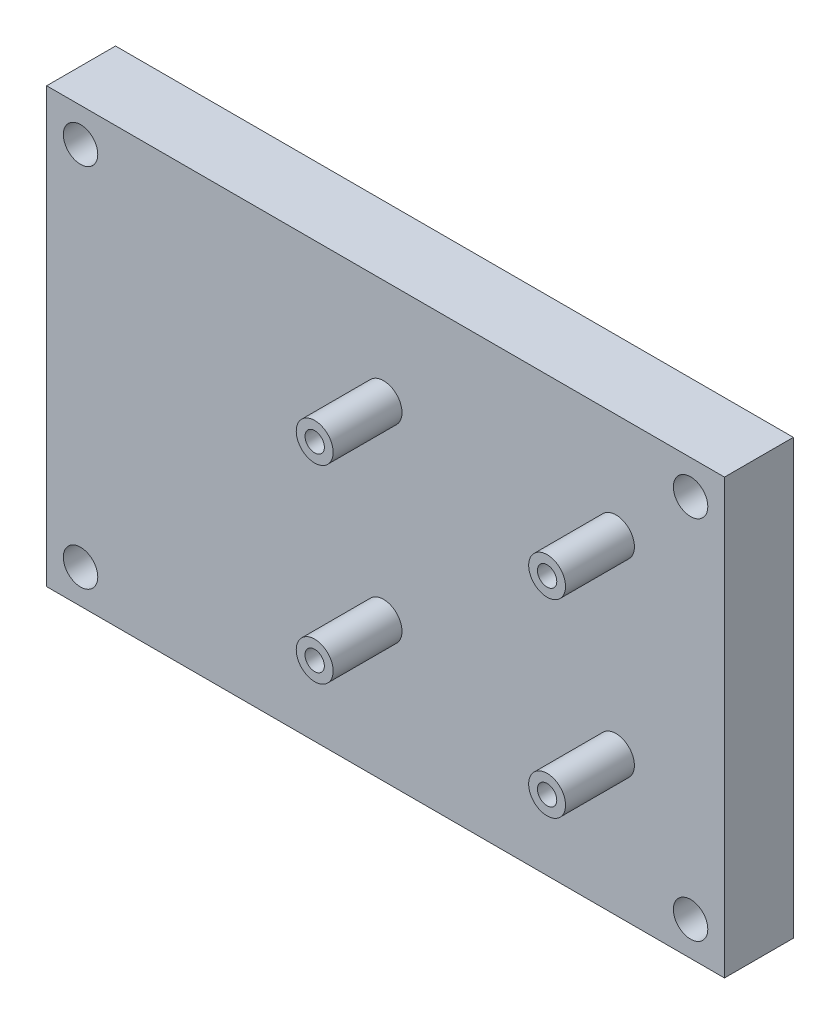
ISO-10303-21;
HEADER;
FILE_DESCRIPTION(('STEP AP214'),'2;1');
FILE_NAME('part.step','',(''),(''),'','','');
FILE_SCHEMA(('AUTOMOTIVE_DESIGN { 1 0 10303 214 1 1 1 1 }'));
ENDSEC;
DATA;
#1=APPLICATION_CONTEXT('core data for automotive mechanical design processes');
#2=APPLICATION_PROTOCOL_DEFINITION('international standard','automotive_design',2000,#1);
#3=PRODUCT_CONTEXT('',#1,'mechanical');
#4=PRODUCT('Part','Part','',(#3));
#5=PRODUCT_RELATED_PRODUCT_CATEGORY('part','',(#4));
#6=PRODUCT_DEFINITION_FORMATION('','',#4);
#7=PRODUCT_DEFINITION_CONTEXT('part definition',#1,'design');
#8=PRODUCT_DEFINITION('design','',#6,#7);
#9=PRODUCT_DEFINITION_SHAPE('','',#8);
#10=(LENGTH_UNIT() NAMED_UNIT(*) SI_UNIT(.MILLI.,.METRE.));
#11=(NAMED_UNIT(*) PLANE_ANGLE_UNIT() SI_UNIT($,.RADIAN.));
#12=(NAMED_UNIT(*) SI_UNIT($,.STERADIAN.) SOLID_ANGLE_UNIT());
#13=UNCERTAINTY_MEASURE_WITH_UNIT(LENGTH_MEASURE(1.E-05),#10,'distance_accuracy_value','');
#14=(GEOMETRIC_REPRESENTATION_CONTEXT(3) GLOBAL_UNCERTAINTY_ASSIGNED_CONTEXT((#13)) GLOBAL_UNIT_ASSIGNED_CONTEXT((#10,
#11,#12)) REPRESENTATION_CONTEXT('',''));
#15=CARTESIAN_POINT('',(0.,0.,0.));
#16=DIRECTION('',(0.,0.,1.));
#17=DIRECTION('',(1.,0.,0.));
#18=AXIS2_PLACEMENT_3D('',#15,#16,#17);
#19=CARTESIAN_POINT('',(0.,0.,0.));
#20=DIRECTION('',(0.,0.,-1.));
#21=DIRECTION('',(-1.,0.,0.));
#22=AXIS2_PLACEMENT_3D('',#19,#20,#21);
#23=PLANE('',#22);
#24=CARTESIAN_POINT('',(62.1283709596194,60.5614108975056,0.));
#25=DIRECTION('',(0.,0.,1.));
#26=DIRECTION('',(1.,0.,0.));
#27=AXIS2_PLACEMENT_3D('',#24,#25,#26);
#28=CIRCLE('',#27,1.78434999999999);
#29=CARTESIAN_POINT('',(63.9127209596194,60.5614108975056,0.));
#30=VERTEX_POINT('',#29);
#31=EDGE_CURVE('E233',#30,#30,#28,.T.);
#32=ORIENTED_EDGE('',*,*,#31,.T.);
#33=EDGE_LOOP('',(#32));
#34=FACE_BOUND('',#33,.T.);
#35=CARTESIAN_POINT('',(104.990870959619,60.5614108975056,0.));
#36=DIRECTION('',(0.,0.,1.));
#37=DIRECTION('',(1.,0.,0.));
#38=AXIS2_PLACEMENT_3D('',#35,#36,#37);
#39=CIRCLE('',#38,1.78434999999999);
#40=CARTESIAN_POINT('',(106.775220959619,60.5614108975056,0.));
#41=VERTEX_POINT('',#40);
#42=EDGE_CURVE('E225',#41,#41,#39,.T.);
#43=ORIENTED_EDGE('',*,*,#42,.T.);
#44=EDGE_LOOP('',(#43));
#45=FACE_BOUND('',#44,.T.);
#46=CARTESIAN_POINT('',(104.988370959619,25.6364108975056,0.));
#47=DIRECTION('',(0.,0.,1.));
#48=DIRECTION('',(1.,0.,0.));
#49=AXIS2_PLACEMENT_3D('',#46,#47,#48);
#50=CIRCLE('',#49,1.78434999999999);
#51=CARTESIAN_POINT('',(106.772720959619,25.6364108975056,0.));
#52=VERTEX_POINT('',#51);
#53=EDGE_CURVE('E209',#52,#52,#50,.T.);
#54=ORIENTED_EDGE('',*,*,#53,.T.);
#55=EDGE_LOOP('',(#54));
#56=FACE_BOUND('',#55,.T.);
#57=CARTESIAN_POINT('',(6.25,73.75,0.));
#58=DIRECTION('',(0.,0.,1.));
#59=DIRECTION('',(1.,0.,0.));
#60=AXIS2_PLACEMENT_3D('',#57,#58,#59);
#61=CIRCLE('',#60,3.175);
#62=CARTESIAN_POINT('',(9.425,73.75,0.));
#63=VERTEX_POINT('',#62);
#64=EDGE_CURVE('E181',#63,#63,#61,.T.);
#65=ORIENTED_EDGE('',*,*,#64,.T.);
#66=EDGE_LOOP('',(#65));
#67=FACE_BOUND('',#66,.T.);
#68=CARTESIAN_POINT('',(118.75,6.25,0.));
#69=DIRECTION('',(0.,0.,1.));
#70=DIRECTION('',(1.,0.,0.));
#71=AXIS2_PLACEMENT_3D('',#68,#69,#70);
#72=CIRCLE('',#71,3.175);
#73=CARTESIAN_POINT('',(121.925,6.25,0.));
#74=VERTEX_POINT('',#73);
#75=EDGE_CURVE('E188',#74,#74,#72,.T.);
#76=ORIENTED_EDGE('',*,*,#75,.T.);
#77=EDGE_LOOP('',(#76));
#78=FACE_BOUND('',#77,.T.);
#79=CARTESIAN_POINT('',(6.25,6.25000000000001,0.));
#80=DIRECTION('',(0.,0.,1.));
#81=DIRECTION('',(1.,0.,0.));
#82=AXIS2_PLACEMENT_3D('',#79,#80,#81);
#83=CIRCLE('',#82,3.175);
#84=CARTESIAN_POINT('',(9.425,6.25000000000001,0.));
#85=VERTEX_POINT('',#84);
#86=EDGE_CURVE('E169',#85,#85,#83,.T.);
#87=ORIENTED_EDGE('',*,*,#86,.T.);
#88=EDGE_LOOP('',(#87));
#89=FACE_BOUND('',#88,.T.);
#90=CARTESIAN_POINT('',(118.75,73.75,0.));
#91=DIRECTION('',(0.,0.,1.));
#92=DIRECTION('',(1.,0.,0.));
#93=AXIS2_PLACEMENT_3D('',#90,#91,#92);
#94=CIRCLE('',#93,3.175);
#95=CARTESIAN_POINT('',(121.925,73.75,0.));
#96=VERTEX_POINT('',#95);
#97=EDGE_CURVE('E116',#96,#96,#94,.T.);
#98=ORIENTED_EDGE('',*,*,#97,.T.);
#99=EDGE_LOOP('',(#98));
#100=FACE_BOUND('',#99,.T.);
#101=DIRECTION('',(0.,-1.,0.));
#102=VECTOR('',#101,1.);
#103=CARTESIAN_POINT('',(0.,0.,0.));
#104=LINE('',#103,#102);
#105=CARTESIAN_POINT('',(0.,80.,0.));
#106=VERTEX_POINT('',#105);
#107=CARTESIAN_POINT('',(0.,0.,0.));
#108=VERTEX_POINT('',#107);
#109=EDGE_CURVE('E112',#106,#108,#104,.T.);
#110=ORIENTED_EDGE('',*,*,#109,.F.);
#111=DIRECTION('',(-1.,0.,0.));
#112=VECTOR('',#111,1.);
#113=CARTESIAN_POINT('',(0.,80.,0.));
#114=LINE('',#113,#112);
#115=CARTESIAN_POINT('',(125.,80.,0.));
#116=VERTEX_POINT('',#115);
#117=EDGE_CURVE('E80',#116,#106,#114,.T.);
#118=ORIENTED_EDGE('',*,*,#117,.F.);
#119=DIRECTION('',(0.,1.,0.));
#120=VECTOR('',#119,1.);
#121=CARTESIAN_POINT('',(125.,0.,0.));
#122=LINE('',#121,#120);
#123=CARTESIAN_POINT('',(125.,0.,0.));
#124=VERTEX_POINT('',#123);
#125=EDGE_CURVE('E74',#124,#116,#122,.T.);
#126=ORIENTED_EDGE('',*,*,#125,.F.);
#127=DIRECTION('',(1.,0.,0.));
#128=VECTOR('',#127,1.);
#129=CARTESIAN_POINT('',(0.,0.,0.));
#130=LINE('',#129,#128);
#131=EDGE_CURVE('E99',#108,#124,#130,.T.);
#132=ORIENTED_EDGE('',*,*,#131,.F.);
#133=EDGE_LOOP('',(#110,#118,#126,#132));
#134=FACE_BOUND('',#133,.T.);
#135=CARTESIAN_POINT('',(62.1283709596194,25.6364108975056,0.));
#136=DIRECTION('',(0.,0.,1.));
#137=DIRECTION('',(1.,0.,0.));
#138=AXIS2_PLACEMENT_3D('',#135,#136,#137);
#139=CIRCLE('',#138,1.78435);
#140=CARTESIAN_POINT('',(63.9127209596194,25.6364108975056,0.));
#141=VERTEX_POINT('',#140);
#142=EDGE_CURVE('E217',#141,#141,#139,.T.);
#143=ORIENTED_EDGE('',*,*,#142,.T.);
#144=EDGE_LOOP('',(#143));
#145=FACE_BOUND('',#144,.T.);
#146=ADVANCED_FACE('F39',(#34,#45,#56,#67,#78,#89,#100,#134,#145),#23,.T.);
#147=CARTESIAN_POINT('',(0.,0.,12.7));
#148=DIRECTION('',(1.,0.,0.));
#149=DIRECTION('',(0.,0.,-1.));
#150=AXIS2_PLACEMENT_3D('',#147,#148,#149);
#151=PLANE('',#150);
#152=ORIENTED_EDGE('',*,*,#109,.T.);
#153=DIRECTION('',(0.,0.,-1.));
#154=VECTOR('',#153,1.);
#155=CARTESIAN_POINT('',(0.,0.,12.7));
#156=LINE('',#155,#154);
#157=CARTESIAN_POINT('',(0.,0.,12.7));
#158=VERTEX_POINT('',#157);
#159=EDGE_CURVE('E101',#158,#108,#156,.T.);
#160=ORIENTED_EDGE('',*,*,#159,.F.);
#161=DIRECTION('',(0.,-1.,0.));
#162=VECTOR('',#161,1.);
#163=CARTESIAN_POINT('',(0.,0.,12.7));
#164=LINE('',#163,#162);
#165=CARTESIAN_POINT('',(0.,80.,12.7));
#166=VERTEX_POINT('',#165);
#167=EDGE_CURVE('E93',#166,#158,#164,.T.);
#168=ORIENTED_EDGE('',*,*,#167,.F.);
#169=DIRECTION('',(0.,0.,-1.));
#170=VECTOR('',#169,1.);
#171=CARTESIAN_POINT('',(0.,80.,12.7));
#172=LINE('',#171,#170);
#173=EDGE_CURVE('E108',#166,#106,#172,.T.);
#174=ORIENTED_EDGE('',*,*,#173,.T.);
#175=EDGE_LOOP('',(#152,#160,#168,#174));
#176=FACE_BOUND('',#175,.T.);
#177=ADVANCED_FACE('F41',(#176),#151,.F.);
#178=CARTESIAN_POINT('',(0.,0.,12.7));
#179=DIRECTION('',(0.,1.,0.));
#180=DIRECTION('',(0.,0.,1.));
#181=AXIS2_PLACEMENT_3D('',#178,#179,#180);
#182=PLANE('',#181);
#183=ORIENTED_EDGE('',*,*,#131,.T.);
#184=DIRECTION('',(0.,0.,-1.));
#185=VECTOR('',#184,1.);
#186=CARTESIAN_POINT('',(125.,0.,12.7));
#187=LINE('',#186,#185);
#188=CARTESIAN_POINT('',(125.,0.,12.7));
#189=VERTEX_POINT('',#188);
#190=EDGE_CURVE('E97',#189,#124,#187,.T.);
#191=ORIENTED_EDGE('',*,*,#190,.F.);
#192=DIRECTION('',(1.,0.,0.));
#193=VECTOR('',#192,1.);
#194=CARTESIAN_POINT('',(0.,0.,12.7));
#195=LINE('',#194,#193);
#196=EDGE_CURVE('E88',#158,#189,#195,.T.);
#197=ORIENTED_EDGE('',*,*,#196,.F.);
#198=ORIENTED_EDGE('',*,*,#159,.T.);
#199=EDGE_LOOP('',(#183,#191,#197,#198));
#200=FACE_BOUND('',#199,.T.);
#201=ADVANCED_FACE('F98',(#200),#182,.F.);
#202=CARTESIAN_POINT('',(125.,0.,12.7));
#203=DIRECTION('',(-1.,0.,0.));
#204=DIRECTION('',(0.,0.,1.));
#205=AXIS2_PLACEMENT_3D('',#202,#203,#204);
#206=PLANE('',#205);
#207=ORIENTED_EDGE('',*,*,#125,.T.);
#208=DIRECTION('',(0.,0.,-1.));
#209=VECTOR('',#208,1.);
#210=CARTESIAN_POINT('',(125.,80.,12.7));
#211=LINE('',#210,#209);
#212=CARTESIAN_POINT('',(125.,80.,12.7));
#213=VERTEX_POINT('',#212);
#214=EDGE_CURVE('E102',#213,#116,#211,.T.);
#215=ORIENTED_EDGE('',*,*,#214,.F.);
#216=DIRECTION('',(0.,1.,0.));
#217=VECTOR('',#216,1.);
#218=CARTESIAN_POINT('',(125.,0.,12.7));
#219=LINE('',#218,#217);
#220=EDGE_CURVE('E91',#189,#213,#219,.T.);
#221=ORIENTED_EDGE('',*,*,#220,.F.);
#222=ORIENTED_EDGE('',*,*,#190,.T.);
#223=EDGE_LOOP('',(#207,#215,#221,#222));
#224=FACE_BOUND('',#223,.T.);
#225=ADVANCED_FACE('F104',(#224),#206,.F.);
#226=CARTESIAN_POINT('',(0.,80.,12.7));
#227=DIRECTION('',(0.,-1.,0.));
#228=DIRECTION('',(0.,0.,-1.));
#229=AXIS2_PLACEMENT_3D('',#226,#227,#228);
#230=PLANE('',#229);
#231=ORIENTED_EDGE('',*,*,#117,.T.);
#232=ORIENTED_EDGE('',*,*,#173,.F.);
#233=DIRECTION('',(-1.,0.,0.));
#234=VECTOR('',#233,1.);
#235=CARTESIAN_POINT('',(0.,80.,12.7));
#236=LINE('',#235,#234);
#237=EDGE_CURVE('E57',#213,#166,#236,.T.);
#238=ORIENTED_EDGE('',*,*,#237,.F.);
#239=ORIENTED_EDGE('',*,*,#214,.T.);
#240=EDGE_LOOP('',(#231,#232,#238,#239));
#241=FACE_BOUND('',#240,.T.);
#242=ADVANCED_FACE('F145',(#241),#230,.F.);
#243=CARTESIAN_POINT('',(0.,0.,12.7));
#244=DIRECTION('',(0.,0.,-1.));
#245=DIRECTION('',(-1.,0.,0.));
#246=AXIS2_PLACEMENT_3D('',#243,#244,#245);
#247=PLANE('',#246);
#248=CARTESIAN_POINT('',(104.988370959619,25.6364108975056,12.7));
#249=DIRECTION('',(0.,0.,-1.));
#250=DIRECTION('',(-1.,0.,0.));
#251=AXIS2_PLACEMENT_3D('',#248,#249,#250);
#252=CIRCLE('',#251,3.40194036);
#253=CARTESIAN_POINT('',(101.586430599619,25.6364108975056,12.7));
#254=VERTEX_POINT('',#253);
#255=EDGE_CURVE('E11',#254,#254,#252,.F.);
#256=ORIENTED_EDGE('',*,*,#255,.F.);
#257=EDGE_LOOP('',(#256));
#258=FACE_BOUND('',#257,.T.);
#259=CARTESIAN_POINT('',(62.1283709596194,25.6364108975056,12.7));
#260=DIRECTION('',(0.,0.,-1.));
#261=DIRECTION('',(-1.,0.,0.));
#262=AXIS2_PLACEMENT_3D('',#259,#260,#261);
#263=CIRCLE('',#262,3.40194036);
#264=CARTESIAN_POINT('',(58.7264305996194,25.6364108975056,12.7));
#265=VERTEX_POINT('',#264);
#266=EDGE_CURVE('E49',#265,#265,#263,.F.);
#267=ORIENTED_EDGE('',*,*,#266,.F.);
#268=EDGE_LOOP('',(#267));
#269=FACE_BOUND('',#268,.T.);
#270=CARTESIAN_POINT('',(104.990870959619,60.5614108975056,12.7));
#271=DIRECTION('',(0.,0.,-1.));
#272=DIRECTION('',(-1.,0.,0.));
#273=AXIS2_PLACEMENT_3D('',#270,#271,#272);
#274=CIRCLE('',#273,3.40194036);
#275=CARTESIAN_POINT('',(101.588930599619,60.5614108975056,12.7));
#276=VERTEX_POINT('',#275);
#277=EDGE_CURVE('E133',#276,#276,#274,.F.);
#278=ORIENTED_EDGE('',*,*,#277,.F.);
#279=EDGE_LOOP('',(#278));
#280=FACE_BOUND('',#279,.T.);
#281=CARTESIAN_POINT('',(62.1283709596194,60.5614108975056,12.7));
#282=DIRECTION('',(0.,0.,-1.));
#283=DIRECTION('',(-1.,0.,0.));
#284=AXIS2_PLACEMENT_3D('',#281,#282,#283);
#285=CIRCLE('',#284,3.40194036);
#286=CARTESIAN_POINT('',(58.7264305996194,60.5614108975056,12.7));
#287=VERTEX_POINT('',#286);
#288=EDGE_CURVE('E129',#287,#287,#285,.F.);
#289=ORIENTED_EDGE('',*,*,#288,.F.);
#290=EDGE_LOOP('',(#289));
#291=FACE_BOUND('',#290,.T.);
#292=CARTESIAN_POINT('',(6.25,73.75,12.7));
#293=DIRECTION('',(0.,0.,1.));
#294=DIRECTION('',(1.,0.,0.));
#295=AXIS2_PLACEMENT_3D('',#292,#293,#294);
#296=CIRCLE('',#295,3.175);
#297=CARTESIAN_POINT('',(9.425,73.75,12.7));
#298=VERTEX_POINT('',#297);
#299=EDGE_CURVE('E155',#298,#298,#296,.T.);
#300=ORIENTED_EDGE('',*,*,#299,.F.);
#301=EDGE_LOOP('',(#300));
#302=FACE_BOUND('',#301,.T.);
#303=CARTESIAN_POINT('',(118.75,6.25,12.7));
#304=DIRECTION('',(0.,0.,1.));
#305=DIRECTION('',(1.,0.,0.));
#306=AXIS2_PLACEMENT_3D('',#303,#304,#305);
#307=CIRCLE('',#306,3.175);
#308=CARTESIAN_POINT('',(121.925,6.25,12.7));
#309=VERTEX_POINT('',#308);
#310=EDGE_CURVE('E159',#309,#309,#307,.T.);
#311=ORIENTED_EDGE('',*,*,#310,.F.);
#312=EDGE_LOOP('',(#311));
#313=FACE_BOUND('',#312,.T.);
#314=CARTESIAN_POINT('',(6.25,6.25000000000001,12.7));
#315=DIRECTION('',(0.,0.,1.));
#316=DIRECTION('',(1.,0.,0.));
#317=AXIS2_PLACEMENT_3D('',#314,#315,#316);
#318=CIRCLE('',#317,3.175);
#319=CARTESIAN_POINT('',(9.425,6.25000000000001,12.7));
#320=VERTEX_POINT('',#319);
#321=EDGE_CURVE('E163',#320,#320,#318,.T.);
#322=ORIENTED_EDGE('',*,*,#321,.F.);
#323=EDGE_LOOP('',(#322));
#324=FACE_BOUND('',#323,.T.);
#325=CARTESIAN_POINT('',(118.75,73.75,12.7));
#326=DIRECTION('',(0.,0.,1.));
#327=DIRECTION('',(1.,0.,0.));
#328=AXIS2_PLACEMENT_3D('',#325,#326,#327);
#329=CIRCLE('',#328,3.175);
#330=CARTESIAN_POINT('',(121.925,73.75,12.7));
#331=VERTEX_POINT('',#330);
#332=EDGE_CURVE('E166',#331,#331,#329,.T.);
#333=ORIENTED_EDGE('',*,*,#332,.F.);
#334=EDGE_LOOP('',(#333));
#335=FACE_BOUND('',#334,.T.);
#336=ORIENTED_EDGE('',*,*,#167,.T.);
#337=ORIENTED_EDGE('',*,*,#196,.T.);
#338=ORIENTED_EDGE('',*,*,#220,.T.);
#339=ORIENTED_EDGE('',*,*,#237,.T.);
#340=EDGE_LOOP('',(#336,#337,#338,#339));
#341=FACE_BOUND('',#340,.T.);
#342=ADVANCED_FACE('F89',(#258,#269,#280,#291,#302,#313,#324,#335,#341),#247,.F.);
#343=CARTESIAN_POINT('',(118.75,73.75,0.));
#344=DIRECTION('',(0.,0.,1.));
#345=DIRECTION('',(1.,0.,0.));
#346=AXIS2_PLACEMENT_3D('',#343,#344,#345);
#347=CYLINDRICAL_SURFACE('',#346,3.175);
#348=ORIENTED_EDGE('',*,*,#97,.F.);
#349=EDGE_LOOP('',(#348));
#350=FACE_BOUND('',#349,.T.);
#351=ORIENTED_EDGE('',*,*,#332,.T.);
#352=EDGE_LOOP('',(#351));
#353=FACE_BOUND('',#352,.T.);
#354=ADVANCED_FACE('F144',(#350,#353),#347,.F.);
#355=CARTESIAN_POINT('',(6.25,6.25000000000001,0.));
#356=DIRECTION('',(0.,0.,1.));
#357=DIRECTION('',(1.,0.,0.));
#358=AXIS2_PLACEMENT_3D('',#355,#356,#357);
#359=CYLINDRICAL_SURFACE('',#358,3.175);
#360=ORIENTED_EDGE('',*,*,#86,.F.);
#361=EDGE_LOOP('',(#360));
#362=FACE_BOUND('',#361,.T.);
#363=ORIENTED_EDGE('',*,*,#321,.T.);
#364=EDGE_LOOP('',(#363));
#365=FACE_BOUND('',#364,.T.);
#366=ADVANCED_FACE('F300',(#362,#365),#359,.F.);
#367=CARTESIAN_POINT('',(118.75,6.25,0.));
#368=DIRECTION('',(0.,0.,1.));
#369=DIRECTION('',(1.,0.,0.));
#370=AXIS2_PLACEMENT_3D('',#367,#368,#369);
#371=CYLINDRICAL_SURFACE('',#370,3.175);
#372=ORIENTED_EDGE('',*,*,#75,.F.);
#373=EDGE_LOOP('',(#372));
#374=FACE_BOUND('',#373,.T.);
#375=ORIENTED_EDGE('',*,*,#310,.T.);
#376=EDGE_LOOP('',(#375));
#377=FACE_BOUND('',#376,.T.);
#378=ADVANCED_FACE('F259',(#374,#377),#371,.F.);
#379=CARTESIAN_POINT('',(6.25,73.75,0.));
#380=DIRECTION('',(0.,0.,1.));
#381=DIRECTION('',(1.,0.,0.));
#382=AXIS2_PLACEMENT_3D('',#379,#380,#381);
#383=CYLINDRICAL_SURFACE('',#382,3.175);
#384=ORIENTED_EDGE('',*,*,#64,.F.);
#385=EDGE_LOOP('',(#384));
#386=FACE_BOUND('',#385,.T.);
#387=ORIENTED_EDGE('',*,*,#299,.T.);
#388=EDGE_LOOP('',(#387));
#389=FACE_BOUND('',#388,.T.);
#390=ADVANCED_FACE('F254',(#386,#389),#383,.F.);
#391=CARTESIAN_POINT('',(62.1283709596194,60.5614108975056,25.4));
#392=DIRECTION('',(0.,0.,-1.));
#393=DIRECTION('',(-1.,0.,0.));
#394=AXIS2_PLACEMENT_3D('',#391,#392,#393);
#395=CYLINDRICAL_SURFACE('',#394,3.40194036);
#396=CARTESIAN_POINT('',(62.1283709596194,60.5614108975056,25.4));
#397=DIRECTION('',(0.,0.,1.));
#398=DIRECTION('',(1.,0.,0.));
#399=AXIS2_PLACEMENT_3D('',#396,#397,#398);
#400=CIRCLE('',#399,3.40194036);
#401=CARTESIAN_POINT('',(65.5303113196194,60.5614108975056,25.4));
#402=VERTEX_POINT('',#401);
#403=EDGE_CURVE('E182',#402,#402,#400,.T.);
#404=ORIENTED_EDGE('',*,*,#403,.F.);
#405=EDGE_LOOP('',(#404));
#406=FACE_BOUND('',#405,.T.);
#407=ORIENTED_EDGE('',*,*,#288,.T.);
#408=EDGE_LOOP('',(#407));
#409=FACE_BOUND('',#408,.T.);
#410=ADVANCED_FACE('F248',(#406,#409),#395,.T.);
#411=CARTESIAN_POINT('',(62.1283709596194,60.5614108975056,25.4));
#412=DIRECTION('',(0.,0.,1.));
#413=DIRECTION('',(1.,0.,0.));
#414=AXIS2_PLACEMENT_3D('',#411,#412,#413);
#415=PLANE('',#414);
#416=CARTESIAN_POINT('',(62.1283709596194,60.5614108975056,25.4));
#417=DIRECTION('',(0.,0.,1.));
#418=DIRECTION('',(1.,0.,0.));
#419=AXIS2_PLACEMENT_3D('',#416,#417,#418);
#420=CIRCLE('',#419,1.78435);
#421=CARTESIAN_POINT('',(63.9127209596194,60.5614108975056,25.4));
#422=VERTEX_POINT('',#421);
#423=EDGE_CURVE('E237',#422,#422,#420,.T.);
#424=ORIENTED_EDGE('',*,*,#423,.F.);
#425=EDGE_LOOP('',(#424));
#426=FACE_BOUND('',#425,.T.);
#427=ORIENTED_EDGE('',*,*,#403,.T.);
#428=EDGE_LOOP('',(#427));
#429=FACE_BOUND('',#428,.T.);
#430=ADVANCED_FACE('F244',(#426,#429),#415,.T.);
#431=CARTESIAN_POINT('',(104.990870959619,60.5614108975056,25.4));
#432=DIRECTION('',(0.,0.,-1.));
#433=DIRECTION('',(-1.,0.,0.));
#434=AXIS2_PLACEMENT_3D('',#431,#432,#433);
#435=CYLINDRICAL_SURFACE('',#434,3.40194036);
#436=CARTESIAN_POINT('',(104.990870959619,60.5614108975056,25.4));
#437=DIRECTION('',(0.,0.,1.));
#438=DIRECTION('',(1.,0.,0.));
#439=AXIS2_PLACEMENT_3D('',#436,#437,#438);
#440=CIRCLE('',#439,3.40194036);
#441=CARTESIAN_POINT('',(108.392811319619,60.5614108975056,25.4));
#442=VERTEX_POINT('',#441);
#443=EDGE_CURVE('E197',#442,#442,#440,.T.);
#444=ORIENTED_EDGE('',*,*,#443,.F.);
#445=EDGE_LOOP('',(#444));
#446=FACE_BOUND('',#445,.T.);
#447=ORIENTED_EDGE('',*,*,#277,.T.);
#448=EDGE_LOOP('',(#447));
#449=FACE_BOUND('',#448,.T.);
#450=ADVANCED_FACE('F247',(#446,#449),#435,.T.);
#451=CARTESIAN_POINT('',(104.990870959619,60.5614108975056,25.4));
#452=DIRECTION('',(0.,0.,1.));
#453=DIRECTION('',(1.,0.,0.));
#454=AXIS2_PLACEMENT_3D('',#451,#452,#453);
#455=PLANE('',#454);
#456=CARTESIAN_POINT('',(104.990870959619,60.5614108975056,25.4));
#457=DIRECTION('',(0.,0.,1.));
#458=DIRECTION('',(1.,0.,0.));
#459=AXIS2_PLACEMENT_3D('',#456,#457,#458);
#460=CIRCLE('',#459,1.78435);
#461=CARTESIAN_POINT('',(106.775220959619,60.5614108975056,25.4));
#462=VERTEX_POINT('',#461);
#463=EDGE_CURVE('E229',#462,#462,#460,.T.);
#464=ORIENTED_EDGE('',*,*,#463,.F.);
#465=EDGE_LOOP('',(#464));
#466=FACE_BOUND('',#465,.T.);
#467=ORIENTED_EDGE('',*,*,#443,.T.);
#468=EDGE_LOOP('',(#467));
#469=FACE_BOUND('',#468,.T.);
#470=ADVANCED_FACE('F339',(#466,#469),#455,.T.);
#471=CARTESIAN_POINT('',(62.1283709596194,25.6364108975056,25.4));
#472=DIRECTION('',(0.,0.,-1.));
#473=DIRECTION('',(-1.,0.,0.));
#474=AXIS2_PLACEMENT_3D('',#471,#472,#473);
#475=CYLINDRICAL_SURFACE('',#474,3.40194036);
#476=CARTESIAN_POINT('',(62.1283709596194,25.6364108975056,25.4));
#477=DIRECTION('',(0.,0.,1.));
#478=DIRECTION('',(1.,0.,0.));
#479=AXIS2_PLACEMENT_3D('',#476,#477,#478);
#480=CIRCLE('',#479,3.40194036);
#481=CARTESIAN_POINT('',(65.5303113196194,25.6364108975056,25.4));
#482=VERTEX_POINT('',#481);
#483=EDGE_CURVE('E201',#482,#482,#480,.T.);
#484=ORIENTED_EDGE('',*,*,#483,.F.);
#485=EDGE_LOOP('',(#484));
#486=FACE_BOUND('',#485,.T.);
#487=ORIENTED_EDGE('',*,*,#266,.T.);
#488=EDGE_LOOP('',(#487));
#489=FACE_BOUND('',#488,.T.);
#490=ADVANCED_FACE('F140',(#486,#489),#475,.T.);
#491=CARTESIAN_POINT('',(62.1283709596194,25.6364108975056,25.4));
#492=DIRECTION('',(0.,0.,1.));
#493=DIRECTION('',(1.,0.,0.));
#494=AXIS2_PLACEMENT_3D('',#491,#492,#493);
#495=PLANE('',#494);
#496=CARTESIAN_POINT('',(62.1283709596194,25.6364108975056,25.4));
#497=DIRECTION('',(0.,0.,1.));
#498=DIRECTION('',(1.,0.,0.));
#499=AXIS2_PLACEMENT_3D('',#496,#497,#498);
#500=CIRCLE('',#499,1.78435);
#501=CARTESIAN_POINT('',(63.9127209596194,25.6364108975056,25.4));
#502=VERTEX_POINT('',#501);
#503=EDGE_CURVE('E221',#502,#502,#500,.T.);
#504=ORIENTED_EDGE('',*,*,#503,.F.);
#505=EDGE_LOOP('',(#504));
#506=FACE_BOUND('',#505,.T.);
#507=ORIENTED_EDGE('',*,*,#483,.T.);
#508=EDGE_LOOP('',(#507));
#509=FACE_BOUND('',#508,.T.);
#510=ADVANCED_FACE('F356',(#506,#509),#495,.T.);
#511=CARTESIAN_POINT('',(104.988370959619,25.6364108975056,25.4));
#512=DIRECTION('',(0.,0.,-1.));
#513=DIRECTION('',(-1.,0.,0.));
#514=AXIS2_PLACEMENT_3D('',#511,#512,#513);
#515=CYLINDRICAL_SURFACE('',#514,3.40194036);
#516=CARTESIAN_POINT('',(104.988370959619,25.6364108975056,25.4));
#517=DIRECTION('',(0.,0.,1.));
#518=DIRECTION('',(1.,0.,0.));
#519=AXIS2_PLACEMENT_3D('',#516,#517,#518);
#520=CIRCLE('',#519,3.40194036);
#521=CARTESIAN_POINT('',(108.390311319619,25.6364108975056,25.4));
#522=VERTEX_POINT('',#521);
#523=EDGE_CURVE('E205',#522,#522,#520,.T.);
#524=ORIENTED_EDGE('',*,*,#523,.F.);
#525=EDGE_LOOP('',(#524));
#526=FACE_BOUND('',#525,.T.);
#527=ORIENTED_EDGE('',*,*,#255,.T.);
#528=EDGE_LOOP('',(#527));
#529=FACE_BOUND('',#528,.T.);
#530=ADVANCED_FACE('F365',(#526,#529),#515,.T.);
#531=CARTESIAN_POINT('',(104.988370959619,25.6364108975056,25.4));
#532=DIRECTION('',(0.,0.,1.));
#533=DIRECTION('',(1.,0.,0.));
#534=AXIS2_PLACEMENT_3D('',#531,#532,#533);
#535=PLANE('',#534);
#536=CARTESIAN_POINT('',(104.988370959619,25.6364108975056,25.4));
#537=DIRECTION('',(0.,0.,1.));
#538=DIRECTION('',(1.,0.,0.));
#539=AXIS2_PLACEMENT_3D('',#536,#537,#538);
#540=CIRCLE('',#539,1.78435);
#541=CARTESIAN_POINT('',(106.772720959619,25.6364108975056,25.4));
#542=VERTEX_POINT('',#541);
#543=EDGE_CURVE('E213',#542,#542,#540,.T.);
#544=ORIENTED_EDGE('',*,*,#543,.F.);
#545=EDGE_LOOP('',(#544));
#546=FACE_BOUND('',#545,.T.);
#547=ORIENTED_EDGE('',*,*,#523,.T.);
#548=EDGE_LOOP('',(#547));
#549=FACE_BOUND('',#548,.T.);
#550=ADVANCED_FACE('F374',(#546,#549),#535,.T.);
#551=CARTESIAN_POINT('',(104.988370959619,25.6364108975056,25.4));
#552=DIRECTION('',(0.,0.,1.));
#553=DIRECTION('',(1.,0.,0.));
#554=AXIS2_PLACEMENT_3D('',#551,#552,#553);
#555=CYLINDRICAL_SURFACE('',#554,1.78435);
#556=ORIENTED_EDGE('',*,*,#53,.F.);
#557=EDGE_LOOP('',(#556));
#558=FACE_BOUND('',#557,.T.);
#559=ORIENTED_EDGE('',*,*,#543,.T.);
#560=EDGE_LOOP('',(#559));
#561=FACE_BOUND('',#560,.T.);
#562=ADVANCED_FACE('F382',(#558,#561),#555,.F.);
#563=CARTESIAN_POINT('',(62.1283709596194,25.6364108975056,25.4));
#564=DIRECTION('',(0.,0.,1.));
#565=DIRECTION('',(1.,0.,0.));
#566=AXIS2_PLACEMENT_3D('',#563,#564,#565);
#567=CYLINDRICAL_SURFACE('',#566,1.78435);
#568=ORIENTED_EDGE('',*,*,#142,.F.);
#569=EDGE_LOOP('',(#568));
#570=FACE_BOUND('',#569,.T.);
#571=ORIENTED_EDGE('',*,*,#503,.T.);
#572=EDGE_LOOP('',(#571));
#573=FACE_BOUND('',#572,.T.);
#574=ADVANCED_FACE('F395',(#570,#573),#567,.F.);
#575=CARTESIAN_POINT('',(104.990870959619,60.5614108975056,25.4));
#576=DIRECTION('',(0.,0.,1.));
#577=DIRECTION('',(1.,0.,0.));
#578=AXIS2_PLACEMENT_3D('',#575,#576,#577);
#579=CYLINDRICAL_SURFACE('',#578,1.78435);
#580=ORIENTED_EDGE('',*,*,#42,.F.);
#581=EDGE_LOOP('',(#580));
#582=FACE_BOUND('',#581,.T.);
#583=ORIENTED_EDGE('',*,*,#463,.T.);
#584=EDGE_LOOP('',(#583));
#585=FACE_BOUND('',#584,.T.);
#586=ADVANCED_FACE('F404',(#582,#585),#579,.F.);
#587=CARTESIAN_POINT('',(62.1283709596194,60.5614108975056,25.4));
#588=DIRECTION('',(0.,0.,1.));
#589=DIRECTION('',(1.,0.,0.));
#590=AXIS2_PLACEMENT_3D('',#587,#588,#589);
#591=CYLINDRICAL_SURFACE('',#590,1.78435);
#592=ORIENTED_EDGE('',*,*,#31,.F.);
#593=EDGE_LOOP('',(#592));
#594=FACE_BOUND('',#593,.T.);
#595=ORIENTED_EDGE('',*,*,#423,.T.);
#596=EDGE_LOOP('',(#595));
#597=FACE_BOUND('',#596,.T.);
#598=ADVANCED_FACE('F242',(#594,#597),#591,.F.);
#599=CLOSED_SHELL('',(#146,#177,#201,#225,#242,#342,#354,#366,#378,#390,#410,#430,#450,#470,
#490,#510,#530,#550,#562,#574,#586,#598));
#600=MANIFOLD_SOLID_BREP('B2',#599);
#601=ADVANCED_BREP_SHAPE_REPRESENTATION('',(#18,#600),#14);
#602=SHAPE_DEFINITION_REPRESENTATION(#9,#601);
ENDSEC;
END-ISO-10303-21;
